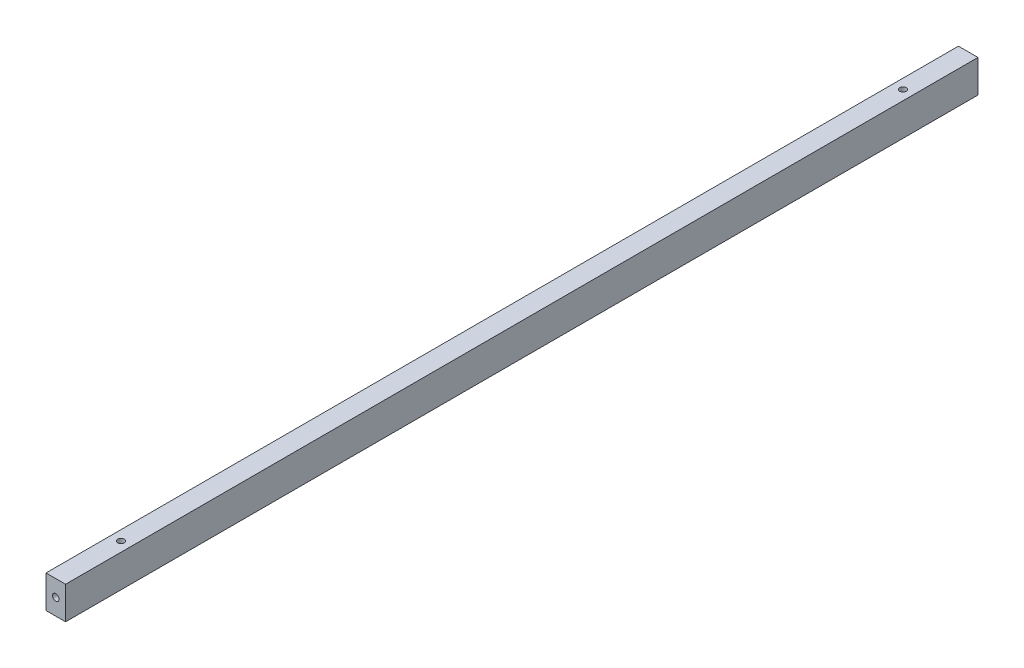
from build123d import *

# Parameters (mm, degrees)
ESQUISSE1_W               = 15
ESQUISSE1_H               = 25
EXTRUSION1_DEPTH          = 350
TROU_TARAUD_M6X1_01_D     = 5
TROU_TARAUD_M6X1_01_DEPTH = 20
TROU_TARAUD_M6X1_01_TIP   = 1.502151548
TROU_TARAUD_M6X1_02_D     = 5
TROU_TARAUD_M6X1_02_DEPTH = 20
TROU_TARAUD_M6X1_02_TIP   = 1.502151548
TROU_TARAUD_M6X1_03_D     = 5


with BuildPart() as part:
    # Esquisse1 → Extrusion1 (new, symmetric)
    with BuildSketch(Plane.XY):
        Rectangle(ESQUISSE1_W, ESQUISSE1_H)
    extrude(amount=EXTRUSION1_DEPTH, both=True)

    # Trou taraud_ M6x1.01
    with Locations(Plane.XY.offset(350)):
        with Locations((0, 0)):
            Hole(TROU_TARAUD_M6X1_01_D / 2, depth=TROU_TARAUD_M6X1_01_DEPTH)
            with Locations((0, 0, -(TROU_TARAUD_M6X1_01_DEPTH + TROU_TARAUD_M6X1_01_TIP / 2))):  # 118° drill point
                Cone(0, TROU_TARAUD_M6X1_01_D / 2, TROU_TARAUD_M6X1_01_TIP, mode=Mode.SUBTRACT)

    # Trou taraud_ M6x1.02
    with Locations(Plane(origin=(0, 0, -350), x_dir=(-1, 0, 0), z_dir=(0, 0, -1))):
        with Locations((0, 0)):
            Hole(TROU_TARAUD_M6X1_02_D / 2, depth=TROU_TARAUD_M6X1_02_DEPTH)
            with Locations((0, 0, -(TROU_TARAUD_M6X1_02_DEPTH + TROU_TARAUD_M6X1_02_TIP / 2))):  # 118° drill point
                Cone(0, TROU_TARAUD_M6X1_02_D / 2, TROU_TARAUD_M6X1_02_TIP, mode=Mode.SUBTRACT)

    # Trou taraud_ M6x1.03 (through all)
    with Locations(Plane(origin=(0, 12.5, 0), x_dir=(-1, 0, 0), z_dir=(0, 1, 0))):
        with Locations((0, 300), (0, -300)):
            Hole(TROU_TARAUD_M6X1_03_D / 2)


solid = part.part
